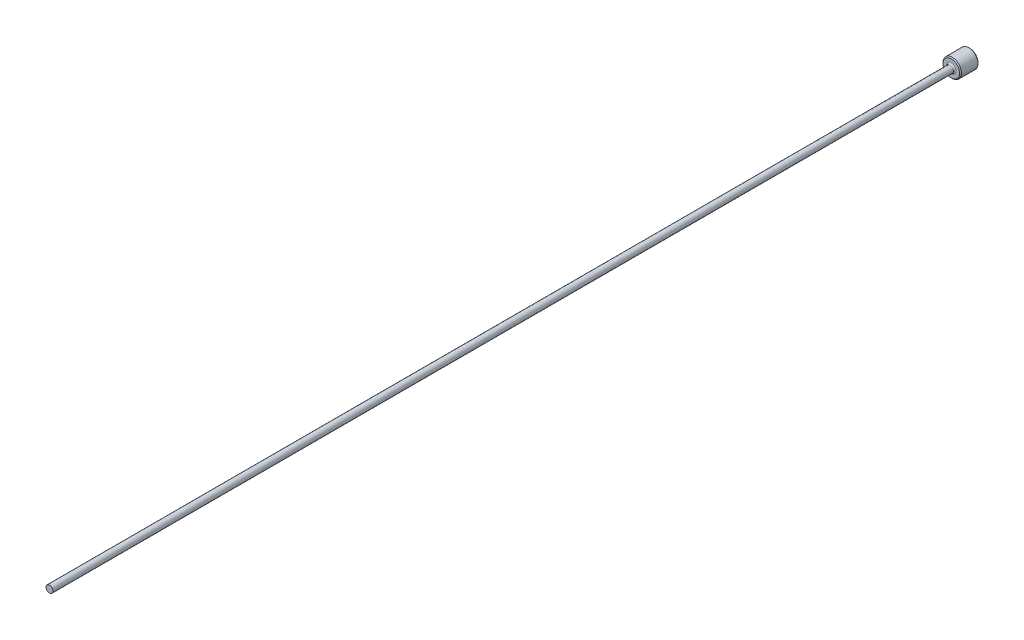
from build123d import *

# Parameters (mm, degrees)
CHAMFER1_SIZE = 0.2


with BuildPart() as part:
    # Sketch1 → Revolve1 (revolve)
    with BuildSketch(Plane(origin=(0, 0, 0), x_dir=(0, 0, -1), z_dir=(1, 0, 0)), mode=Mode.PRIVATE) as revolve1_sk:
        with BuildLine():
            Line((0, 0), (0, 2))
            Line((0, 2), (-4, 2))
            Line((-4, 2), (-4, 1.05))
            ThreePointArc((-4, 1.05), (-4.087867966, 0.837867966), (-4.3, 0.75))
            Line((-4.3, 0.75), (-200, 0.75))
            Line((-200, 0.75), (-200, 0))
            Line((-200, 0), (0, 0))
        make_face()
    revolve(revolve1_sk.sketch.rotate(Axis((0, 0, 109.05062828), (0, 0, -1)), 90), axis=Axis((0, 0, 109.05062828), (0, 0, -1)))

    # Chamfer1
    chamfer1_edges = [part.edges().sort_by_distance(p)[0] for p in [
        (-2, 0, 0),
        (-2, 0, 4),
    ]]
    chamfer(chamfer1_edges, length=CHAMFER1_SIZE)


solid = part.part
